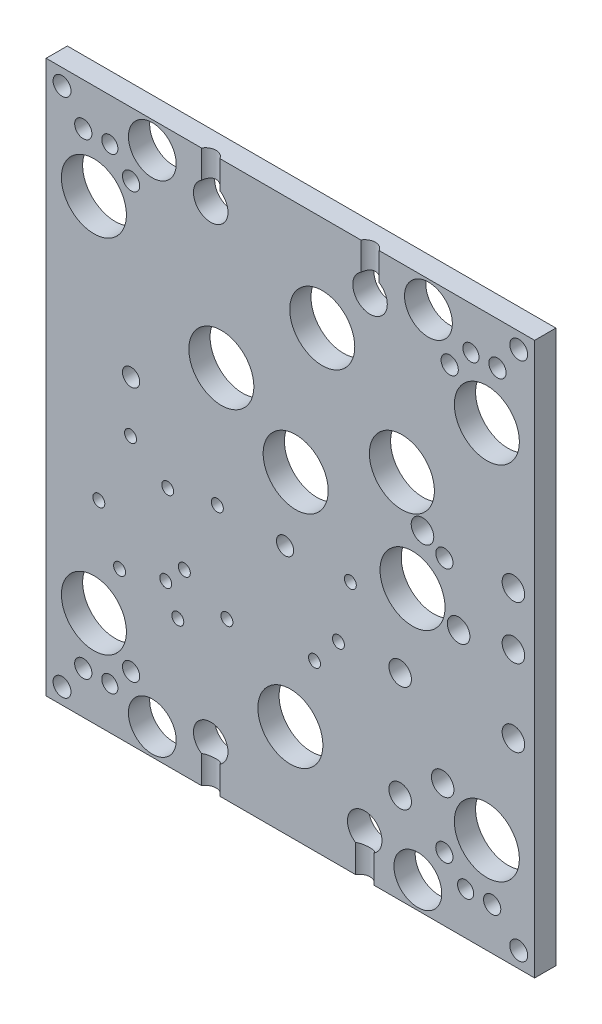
from build123d import *

# Parameters (mm, degrees)
SKETCH1_W           = 292.1
SKETCH1_H           = 330.2
BOSS_EXTRUDE1_DEPTH = 12.7
HOLE12_D            = 7.1374
HOLE13_D            = 7.1374
HOLE14_D            = 7.1374
HOLE15_D            = 7.1374
HOLE16_D            = 7.1374
HOLE17_D            = 38.8874
HOLE18_D            = 28.575
HOLE19_D            = 10.3124
HOLE110_D           = 9.652
HOLE111_D           = 7.1374
HOLE111_CBORE_D     = 10.7188
HOLE111_CBORE_DEPTH = 7.874
HOLE112_D           = 20.6375
HOLE113_D           = 10.31875
CUT_EXTRUDE1_REACH  = 816.283
SKETCH4_R           = 6.35
CUT_EXTRUDE2_REACH  = 816.283
SKETCH5_R           = 6.35
HOLE1_D             = 38.8874
HOLE114_D           = 13.49375


with BuildPart() as part:
    # Sketch1 → Boss-Extrude1 (new body)
    with BuildSketch(Plane.XY):
        with Locations((-598.17, -15.875)):
            Rectangle(SKETCH1_W, SKETCH1_H)
    extrude(amount=BOSS_EXTRUDE1_DEPTH)

    # Hole12 (through all)
    with Locations(Plane(origin=(-580.067928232, -71.915501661, 0), x_dir=(-1, 0, 0), z_dir=(0, 0, -1))):
        with Locations((3.670581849, -10.601140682), (-17.744132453, 40.906909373), (-10.615372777, 6.424197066)):
            Hole(HOLE12_D / 2)

    # Hole13 (through all)
    with Locations(Plane(origin=(-638.171535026, -20.035039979, 0), x_dir=(-1, 0, 0), z_dir=(0, 0, -1))):
        with Locations((3.654260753, -10.973552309), (23.387129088, -54.249177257)):
            Hole(HOLE13_D / 2)

    # Hole14 (through all)
    with Locations(Plane(origin=(-669.032650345, -75.044634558, 0), x_dir=(-1, 0, 0), z_dir=(0, 0, -1))):
        with Locations((3.654260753, -10.601140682), (31.26485292, -18.183728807)):
            Hole(HOLE14_D / 2)

    # Hole15 (through all)
    with Locations(Plane(origin=(-661.826355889, -90.957686, 0), x_dir=(-1, 0, 0), z_dir=(0, 0, -1))):
        with Locations((3.654260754, -10.601140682), (-25.711875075, 3.845190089)):
            Hole(HOLE15_D / 2)

    # Hole16 (through all)
    with Locations(Plane(origin=(-690.083239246, -10.536232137, 0), x_dir=(-1, 0, 0), z_dir=(0, 0, -1))):
        with Locations((3.654260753, -10.601140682), (22.62925804, -53.408015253), (-18.570739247, -26.476140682)):
            Hole(HOLE16_D / 2)

    # Hole17 (through all)
    with Locations(Plane(origin=(-527.953947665, -6.89720218, 12.7), x_dir=(1, 0, 0), z_dir=(0, 0, 1))):
        with Locations((47.258947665, 98.97220218), (-187.691052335, 98.97220218), (-187.691052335, -116.92779782), (-111.491052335, 48.17220218), (-3.541052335, 48.17220218), (-70.216052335, -116.92779782), (-67.041052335, 16.42220218), (-51.166052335, 98.97220218)):
            Hole(HOLE17_D / 2)

    # Hole18 (through all)
    with Locations(Plane(origin=(-505.615739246, -154.498859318, 0), x_dir=(-1, 0, 0), z_dir=(0, 0, -1))):
        with Locations((16.354260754, -10.601140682), (10.004260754, 287.848859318), (175.104260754, 287.848859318), (175.104260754, -10.601140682)):
            Hole(HOLE18_D / 2)

    # Hole19 (through all)
    with Locations(Plane(origin=(-718.340739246, 134.426140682, 0), x_dir=(-1, 0, 0), z_dir=(0, 0, -1))):
        with Locations((3.654260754, -10.601140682), (-243.995739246, -10.601140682), (-240.820739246, -290.001140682), (3.654260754, -290.001140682), (-116.995739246, -166.176140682), (-212.245739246, -124.901140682), (-24.920739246, -124.901140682)):
            Hole(HOLE19_D / 2)

    # Hole110 (through all)
    with Locations(Plane(origin=(-500.224260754, -144.973859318, 12.7), x_dir=(1, 0, 0), z_dir=(0, 0, 1))):
        with Locations((6.829260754, -10.601140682), (-205.895739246, -10.601140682), (-205.895739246, 268.798859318), (10.004260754, 268.798859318)):
            Hole(HOLE110_D / 2)

    # Hole111 (through all)
    with Locations(Plane(origin=(-747.564107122, 140.634999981, 12.7), x_dir=(1, 0, 0), z_dir=(0, 0, 1))):
        with Locations((12.869107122, -0.934999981), (285.919107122, -0.934999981), (285.919107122, -312.084999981), (12.869107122, -312.084999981)):
            CounterBoreHole(HOLE111_D / 2, HOLE111_CBORE_D / 2, HOLE111_CBORE_DEPTH)

    # Hole112 (through all)
    with Locations(Plane(origin=(-655.799260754, 134.426140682, 12.7), x_dir=(1, 0, 0), z_dir=(0, 0, 1))):
        with Locations((10.004260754, -10.601140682), (105.254260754, -10.601140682), (102.079260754, -290.001140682), (10.004260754, -290.001140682)):
            Hole(HOLE112_D / 2)

    # Hole113 (through all)
    with Locations(Plane(origin=(-689.765739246, -132.273859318, 0), x_dir=(-1, 0, 0), z_dir=(0, 0, -1))):
        with Locations((3.654260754, -10.601140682), (-183.670739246, -10.601140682), (-186.845739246, 243.398859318), (3.654260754, 243.398859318)):
            Hole(HOLE113_D / 2)

    # Sketch4 → Cut-Extrude1 (cut, up to next)
    with BuildSketch(Plane.XZ.offset(180.975), mode=Mode.PRIVATE) as cut_extrude1_sk1:
        with Locations((-645.795, 15.875)):
            Circle(SKETCH4_R)
    cut_extrude1_tool1 = extrude(cut_extrude1_sk1.sketch, amount=-CUT_EXTRUDE1_REACH, mode=Mode.PRIVATE) & part.part
    # Sketch4 → Cut-Extrude1 (cut, up to next)
    with BuildSketch(Plane.XZ.offset(180.975), mode=Mode.PRIVATE) as cut_extrude1_sk2:
        with Locations((-553.72, 15.875)):
            Circle(SKETCH4_R)
    cut_extrude1_tool2 = extrude(cut_extrude1_sk2.sketch, amount=-CUT_EXTRUDE1_REACH, mode=Mode.PRIVATE) & part.part
    add(cut_extrude1_tool1.solids().sort_by_distance((-645.795, -180.975, 15.875))[0], mode=Mode.SUBTRACT)
    add(cut_extrude1_tool2.solids().sort_by_distance((-553.72, -180.975, 15.875))[0], mode=Mode.SUBTRACT)

    # Sketch5 → Cut-Extrude2 (cut, up to next)
    with BuildSketch(Plane(origin=(0, 149.225, 0), x_dir=(1, 0, 0), z_dir=(0, 1, 0)), mode=Mode.PRIVATE) as cut_extrude2_sk1:
        with Locations((-550.545, -15.875)):
            Circle(SKETCH5_R)
    cut_extrude2_tool1 = extrude(cut_extrude2_sk1.sketch, amount=-CUT_EXTRUDE2_REACH, mode=Mode.PRIVATE) & part.part
    # Sketch5 → Cut-Extrude2 (cut, up to next)
    with BuildSketch(Plane(origin=(0, 149.225, 0), x_dir=(1, 0, 0), z_dir=(0, 1, 0)), mode=Mode.PRIVATE) as cut_extrude2_sk2:
        with Locations((-645.795, -15.875)):
            Circle(SKETCH5_R)
    cut_extrude2_tool2 = extrude(cut_extrude2_sk2.sketch, amount=-CUT_EXTRUDE2_REACH, mode=Mode.PRIVATE) & part.part
    add(cut_extrude2_tool1.solids().sort_by_distance((-550.545, 149.225, 15.875))[0], mode=Mode.SUBTRACT)
    add(cut_extrude2_tool2.solids().sort_by_distance((-645.795, 149.225, 15.875))[0], mode=Mode.SUBTRACT)

    # Hole1 (through all)
    with Locations(Plane(origin=(-528.799260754, -5.273859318, 12.7), x_dir=(1, 0, 0), z_dir=(0, 0, 1))):
        with Locations((3.654260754, -10.601140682), (48.104260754, -118.551140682)):
            Hole(HOLE1_D / 2)

    # Hole114 (through all)
    with Locations(Plane(origin=(-536.165260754, -116.081359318, 12.7), x_dir=(1, 0, 0), z_dir=(0, 0, 1))):
        with Locations((3.654260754, -10.601140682), (29.054260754, 8.448859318), (71.345260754, 130.686359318), (16.989260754, 133.226359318), (3.654260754, 52.898859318), (38.579260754, 92.586359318), (71.345260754, 52.898859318), (71.345260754, 98.936359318)):
            Hole(HOLE114_D / 2)


solid = part.part
